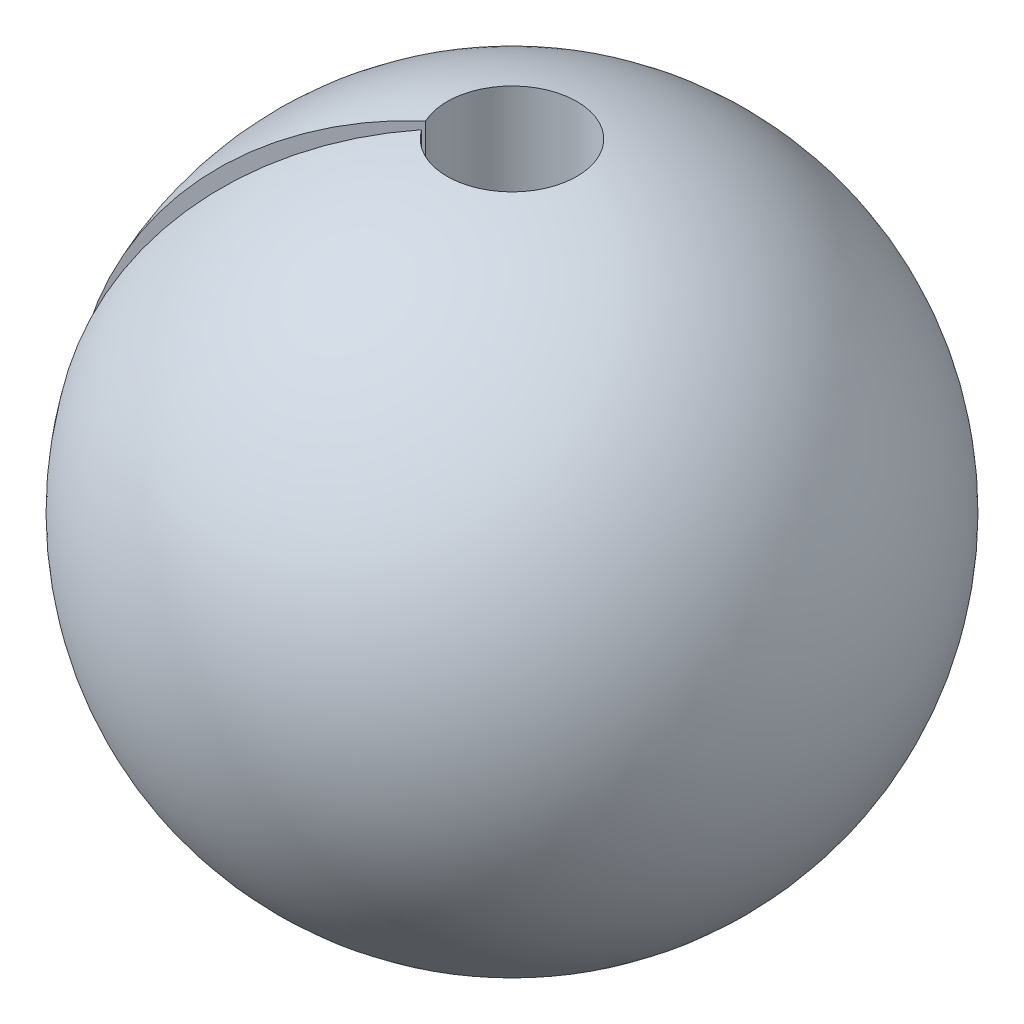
ISO-10303-21;
HEADER;
FILE_DESCRIPTION(('STEP AP214'),'2;1');
FILE_NAME('part.step','',(''),(''),'','','');
FILE_SCHEMA(('AUTOMOTIVE_DESIGN { 1 0 10303 214 1 1 1 1 }'));
ENDSEC;
DATA;
#1=APPLICATION_CONTEXT('core data for automotive mechanical design processes');
#2=APPLICATION_PROTOCOL_DEFINITION('international standard','automotive_design',2000,#1);
#3=PRODUCT_CONTEXT('',#1,'mechanical');
#4=PRODUCT('Part','Part','',(#3));
#5=PRODUCT_RELATED_PRODUCT_CATEGORY('part','',(#4));
#6=PRODUCT_DEFINITION_FORMATION('','',#4);
#7=PRODUCT_DEFINITION_CONTEXT('part definition',#1,'design');
#8=PRODUCT_DEFINITION('design','',#6,#7);
#9=PRODUCT_DEFINITION_SHAPE('','',#8);
#10=(LENGTH_UNIT() NAMED_UNIT(*) SI_UNIT(.MILLI.,.METRE.));
#11=(NAMED_UNIT(*) PLANE_ANGLE_UNIT() SI_UNIT($,.RADIAN.));
#12=(NAMED_UNIT(*) SI_UNIT($,.STERADIAN.) SOLID_ANGLE_UNIT());
#13=UNCERTAINTY_MEASURE_WITH_UNIT(LENGTH_MEASURE(1.E-05),#10,'distance_accuracy_value','');
#14=(GEOMETRIC_REPRESENTATION_CONTEXT(3) GLOBAL_UNCERTAINTY_ASSIGNED_CONTEXT((#13)) GLOBAL_UNIT_ASSIGNED_CONTEXT((#10,
#11,#12)) REPRESENTATION_CONTEXT('',''));
#15=CARTESIAN_POINT('',(0.,0.,0.));
#16=DIRECTION('',(0.,0.,1.));
#17=DIRECTION('',(1.,0.,0.));
#18=AXIS2_PLACEMENT_3D('',#15,#16,#17);
#19=CARTESIAN_POINT('',(0.,215.000000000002,0.));
#20=DIRECTION('',(0.,-1.,0.));
#21=DIRECTION('',(-1.,0.,0.));
#22=AXIS2_PLACEMENT_3D('',#19,#20,#21);
#23=SPHERICAL_SURFACE('',#22,1868.);
#24=CARTESIAN_POINT('',(0.,-1616.39291251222,0.));
#25=DIRECTION('',(0.,-1.,0.));
#26=DIRECTION('',(0.,0.,-1.));
#27=AXIS2_PLACEMENT_3D('',#24,#25,#26);
#28=CIRCLE('',#27,368.);
#29=CARTESIAN_POINT('',(-333.521265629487,-1616.39291251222,155.523520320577));
#30=VERTEX_POINT('',#29);
#31=CARTESIAN_POINT('',(-301.44795229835,-1616.39291251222,211.076128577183));
#32=VERTEX_POINT('',#31);
#33=EDGE_CURVE('E63',#30,#32,#28,.T.);
#34=ORIENTED_EDGE('',*,*,#33,.F.);
#35=CARTESIAN_POINT('',(0.,215.000000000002,1.00620377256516E-13));
#36=DIRECTION('',(-0.422618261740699,0.,-0.90630778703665));
#37=DIRECTION('',(-0.90630778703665,0.,0.422618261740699));
#38=AXIS2_PLACEMENT_3D('',#35,#36,#37);
#39=CIRCLE('',#38,1868.);
#40=CARTESIAN_POINT('',(-333.521265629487,2046.39291251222,155.523520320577));
#41=VERTEX_POINT('',#40);
#42=EDGE_CURVE('E47',#30,#41,#39,.T.);
#43=ORIENTED_EDGE('',*,*,#42,.T.);
#44=CARTESIAN_POINT('',(0.,2046.39291251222,0.));
#45=DIRECTION('',(0.,-1.,0.));
#46=DIRECTION('',(0.,0.,-1.));
#47=AXIS2_PLACEMENT_3D('',#44,#45,#46);
#48=CIRCLE('',#47,368.);
#49=CARTESIAN_POINT('',(-301.44795229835,2046.39291251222,211.076128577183));
#50=VERTEX_POINT('',#49);
#51=EDGE_CURVE('E66',#41,#50,#48,.T.);
#52=ORIENTED_EDGE('',*,*,#51,.T.);
#53=CARTESIAN_POINT('',(0.,215.000000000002,0.));
#54=DIRECTION('',(0.57357643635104,0.,0.819152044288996));
#55=DIRECTION('',(0.819152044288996,0.,-0.57357643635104));
#56=AXIS2_PLACEMENT_3D('',#53,#54,#55);
#57=CIRCLE('',#56,1868.);
#58=EDGE_CURVE('E53',#50,#32,#57,.T.);
#59=ORIENTED_EDGE('',*,*,#58,.T.);
#60=EDGE_LOOP('',(#34,#43,#52,#59));
#61=FACE_BOUND('',#60,.T.);
#62=ADVANCED_FACE('F34',(#61),#23,.T.);
#63=CARTESIAN_POINT('',(0.,0.,0.));
#64=DIRECTION('',(0.,-1.,0.));
#65=DIRECTION('',(0.,0.,-1.));
#66=AXIS2_PLACEMENT_3D('',#63,#64,#65);
#67=CYLINDRICAL_SURFACE('',#66,368.);
#68=ORIENTED_EDGE('',*,*,#51,.F.);
#69=DIRECTION('',(0.,-1.,0.));
#70=VECTOR('',#69,1.);
#71=CARTESIAN_POINT('',(-333.521265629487,0.,155.523520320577));
#72=LINE('',#71,#70);
#73=EDGE_CURVE('E11',#41,#30,#72,.T.);
#74=ORIENTED_EDGE('',*,*,#73,.T.);
#75=ORIENTED_EDGE('',*,*,#33,.T.);
#76=DIRECTION('',(0.,-1.,0.));
#77=VECTOR('',#76,1.);
#78=CARTESIAN_POINT('',(-301.44795229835,0.,211.076128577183));
#79=LINE('',#78,#77);
#80=EDGE_CURVE('E41',#32,#50,#79,.F.);
#81=ORIENTED_EDGE('',*,*,#80,.T.);
#82=EDGE_LOOP('',(#68,#74,#75,#81));
#83=FACE_BOUND('',#82,.T.);
#84=ADVANCED_FACE('F68',(#83),#67,.F.);
#85=CARTESIAN_POINT('',(0.,-4425.,0.));
#86=DIRECTION('',(0.57357643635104,0.,0.819152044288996));
#87=DIRECTION('',(0.819152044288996,0.,-0.57357643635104));
#88=AXIS2_PLACEMENT_3D('',#85,#86,#87);
#89=PLANE('',#88);
#90=ORIENTED_EDGE('',*,*,#80,.F.);
#91=ORIENTED_EDGE('',*,*,#58,.F.);
#92=EDGE_LOOP('',(#90,#91));
#93=FACE_BOUND('',#92,.T.);
#94=ADVANCED_FACE('F58',(#93),#89,.F.);
#95=CARTESIAN_POINT('',(-1974.32395957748,-4425.,920.64238202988));
#96=DIRECTION('',(-0.422618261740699,0.,-0.90630778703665));
#97=DIRECTION('',(-0.90630778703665,0.,0.422618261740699));
#98=AXIS2_PLACEMENT_3D('',#95,#96,#97);
#99=PLANE('',#98);
#100=ORIENTED_EDGE('',*,*,#73,.F.);
#101=ORIENTED_EDGE('',*,*,#42,.F.);
#102=EDGE_LOOP('',(#100,#101));
#103=FACE_BOUND('',#102,.T.);
#104=ADVANCED_FACE('F72',(#103),#99,.F.);
#105=CLOSED_SHELL('',(#62,#84,#94,#104));
#106=MANIFOLD_SOLID_BREP('B2',#105);
#107=ADVANCED_BREP_SHAPE_REPRESENTATION('',(#18,#106),#14);
#108=SHAPE_DEFINITION_REPRESENTATION(#9,#107);
ENDSEC;
END-ISO-10303-21;
